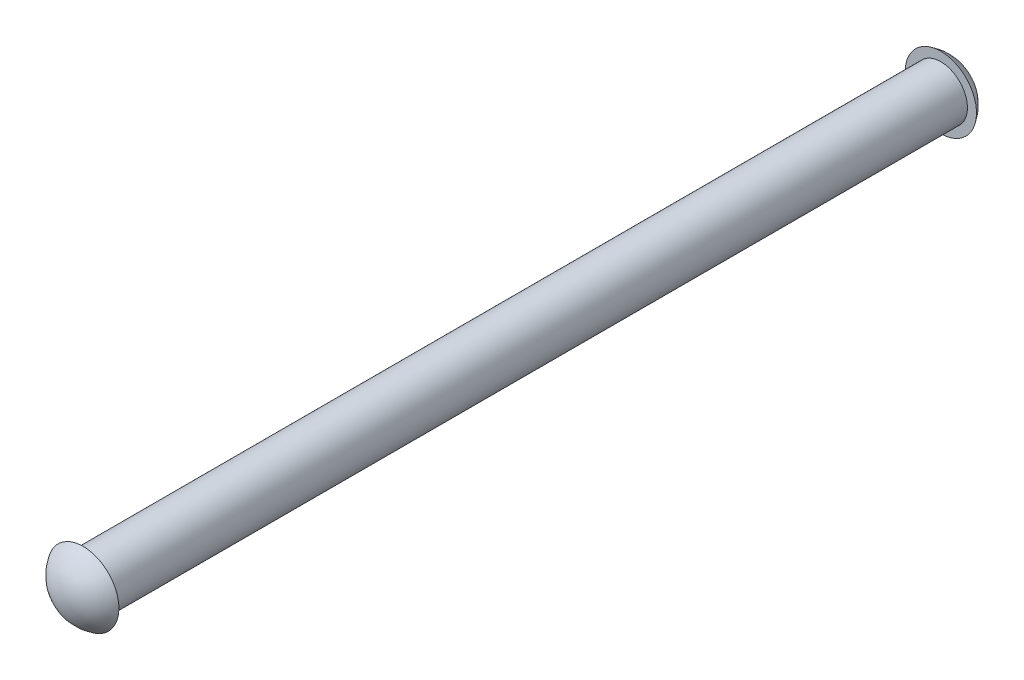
from build123d import *


with BuildPart() as part:
    # Esquisse1 → R_volution1 (revolve)
    with BuildSketch(Plane(origin=(0, 0, 0), x_dir=(0, 0, -1), z_dir=(1, 0, 0)), mode=Mode.PRIVATE) as r_volution1_sk:
        with BuildLine():
            Line((-40.25, 3.35), (-40.25, 2.5))
            Line((-40.25, 2.5), (0, 2.5))
            Line((0, 2.5), (0, 0))
            Line((0, 0), (-42.15, 0))
            ThreePointArc((-42.15, 0), (-41.641934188, 1.925649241), (-40.25, 3.35))
        make_face()
    revolve(r_volution1_sk.sketch.rotate(Axis((0, 0, 0), (0, 0, 1)), 90), axis=Axis((0, 0, 0), (0, 0, 1)))

    # Sym_trie1: part across plane


with BuildPart() as part_1:
    add(part.part)
    add(part.part.mirror(Plane.XY))


solid = part_1.part
